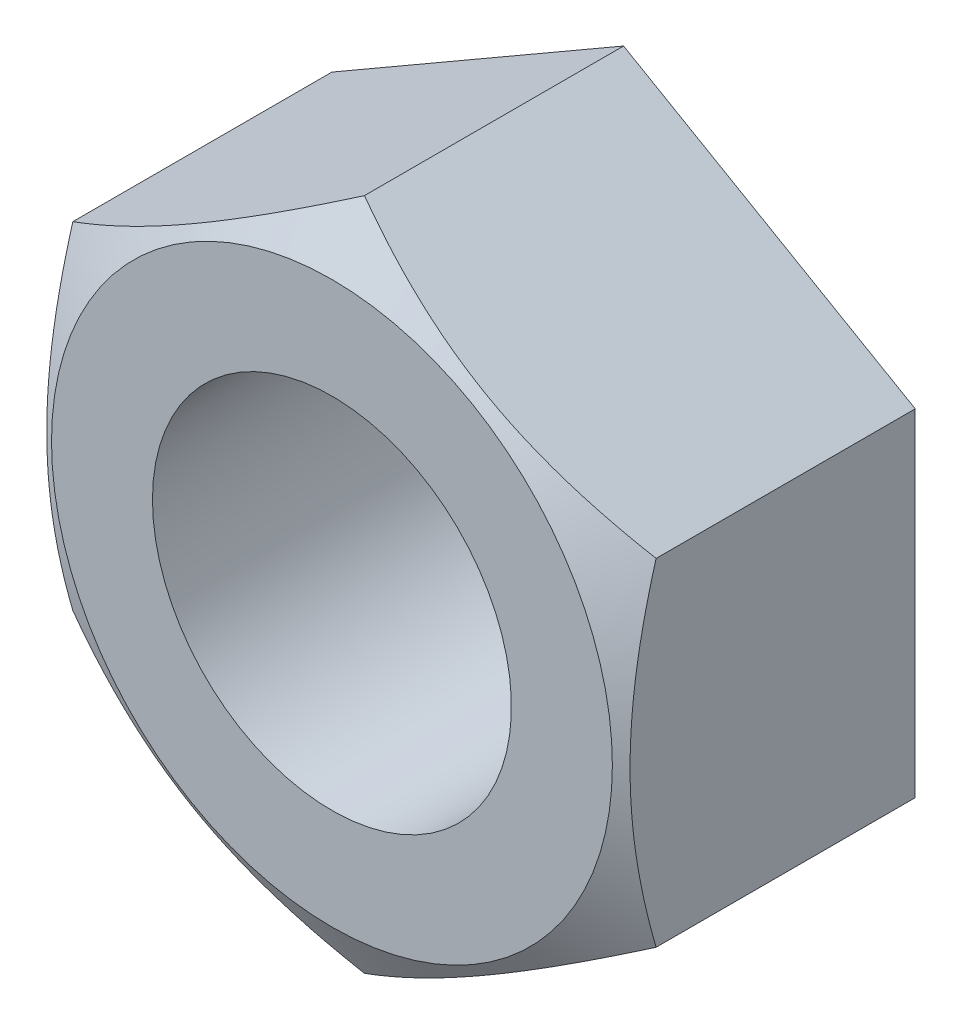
ISO-10303-21;
HEADER;
FILE_DESCRIPTION(('STEP AP214'),'2;1');
FILE_NAME('part.step','',(''),(''),'','','');
FILE_SCHEMA(('AUTOMOTIVE_DESIGN { 1 0 10303 214 1 1 1 1 }'));
ENDSEC;
DATA;
#1=APPLICATION_CONTEXT('core data for automotive mechanical design processes');
#2=APPLICATION_PROTOCOL_DEFINITION('international standard','automotive_design',2000,#1);
#3=PRODUCT_CONTEXT('',#1,'mechanical');
#4=PRODUCT('Part','Part','',(#3));
#5=PRODUCT_RELATED_PRODUCT_CATEGORY('part','',(#4));
#6=PRODUCT_DEFINITION_FORMATION('','',#4);
#7=PRODUCT_DEFINITION_CONTEXT('part definition',#1,'design');
#8=PRODUCT_DEFINITION('design','',#6,#7);
#9=PRODUCT_DEFINITION_SHAPE('','',#8);
#10=(LENGTH_UNIT() NAMED_UNIT(*) SI_UNIT(.MILLI.,.METRE.));
#11=(NAMED_UNIT(*) PLANE_ANGLE_UNIT() SI_UNIT($,.RADIAN.));
#12=(NAMED_UNIT(*) SI_UNIT($,.STERADIAN.) SOLID_ANGLE_UNIT());
#13=UNCERTAINTY_MEASURE_WITH_UNIT(LENGTH_MEASURE(1.E-05),#10,'distance_accuracy_value','');
#14=(GEOMETRIC_REPRESENTATION_CONTEXT(3) GLOBAL_UNCERTAINTY_ASSIGNED_CONTEXT((#13)) GLOBAL_UNIT_ASSIGNED_CONTEXT((#10,
#11,#12)) REPRESENTATION_CONTEXT('',''));
#15=CARTESIAN_POINT('',(0.,0.,0.));
#16=DIRECTION('',(0.,0.,1.));
#17=DIRECTION('',(1.,0.,0.));
#18=AXIS2_PLACEMENT_3D('',#15,#16,#17);
#19=CARTESIAN_POINT('',(-6.5,-3.7527767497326,6.5));
#20=DIRECTION('',(0.5,0.866025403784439,0.));
#21=DIRECTION('',(-0.866025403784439,0.5,0.));
#22=AXIS2_PLACEMENT_3D('',#19,#20,#21);
#23=PLANE('',#22);
#24=DIRECTION('',(0.,0.,-1.));
#25=VECTOR('',#24,1.);
#26=CARTESIAN_POINT('',(0.,-7.5055534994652,6.5));
#27=LINE('',#26,#25);
#28=CARTESIAN_POINT('',(0.,-7.5055534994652,5.77510584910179));
#29=VERTEX_POINT('',#28);
#30=CARTESIAN_POINT('',(0.,-7.5055534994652,0.));
#31=VERTEX_POINT('',#30);
#32=EDGE_CURVE('E9',#29,#31,#27,.T.);
#33=ORIENTED_EDGE('',*,*,#32,.F.);
#34=CARTESIAN_POINT('',(0.000199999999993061,-7.50566896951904,5.77503918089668));
#35=CARTESIAN_POINT('',(-0.142677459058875,-7.42317863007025,5.82265800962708));
#36=CARTESIAN_POINT('',(-0.286087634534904,-7.34038072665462,5.86811573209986));
#37=CARTESIAN_POINT('',(-0.574072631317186,-7.17411251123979,5.95411375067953));
#38=CARTESIAN_POINT('',(-0.718647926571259,-7.09064192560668,5.99465192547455));
#39=CARTESIAN_POINT('',(-1.15468865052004,-6.83889369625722,6.10809143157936));
#40=CARTESIAN_POINT('',(-1.44787528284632,-6.66962231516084,6.17261462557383));
#41=CARTESIAN_POINT('',(-1.88662374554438,-6.41631077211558,6.24827584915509));
#42=CARTESIAN_POINT('',(-2.0308746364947,-6.33302748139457,6.26982957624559));
#43=CARTESIAN_POINT('',(-2.3200282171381,-6.16608458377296,6.30597211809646));
#44=CARTESIAN_POINT('',(-2.4649308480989,-6.08242501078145,6.32056154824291));
#45=CARTESIAN_POINT('',(-2.75498777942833,-5.91496056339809,6.34240368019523));
#46=CARTESIAN_POINT('',(-2.90014160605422,-5.83115596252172,6.34966470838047));
#47=CARTESIAN_POINT('',(-3.19057533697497,-5.66347396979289,6.35670213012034));
#48=CARTESIAN_POINT('',(-3.3358552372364,-5.57959658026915,6.35647875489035));
#49=CARTESIAN_POINT('',(-3.73387594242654,-5.34979921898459,6.34557897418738));
#50=CARTESIAN_POINT('',(-3.9864864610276,-5.2039544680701,6.32728061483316));
#51=CARTESIAN_POINT('',(-4.49002967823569,-4.91323365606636,6.26925609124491));
#52=CARTESIAN_POINT('',(-4.7409606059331,-4.76835861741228,6.22951009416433));
#53=CARTESIAN_POINT('',(-5.24551722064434,-4.47705272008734,6.13015652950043));
#54=CARTESIAN_POINT('',(-5.49907924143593,-4.33065861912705,6.07012800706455));
#55=CARTESIAN_POINT('',(-6.00242193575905,-4.04005357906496,5.93388744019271));
#56=CARTESIAN_POINT('',(-6.25220905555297,-3.89583891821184,5.85770739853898));
#57=CARTESIAN_POINT('',(-6.5002,-3.75266127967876,5.77503918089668));
#58=B_SPLINE_CURVE_WITH_KNOTS('',3,(#34,#35,#36,#37,#38,#39,#40,#41,#42,#43,#44,#45,#46,#47,#48,
#49,#50,#51,#52,#53,#54,#55,#56,#57),.UNSPECIFIED.,.F.,.F.,(4,2,2,2,2,2,2,2,2,2,2,4),(0.,
0.515105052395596,1.03043143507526,2.06322554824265,2.56697389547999,3.07067772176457,
3.57380860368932,4.07692394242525,4.95279354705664,5.8294744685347,6.72559912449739,
7.61996451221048),.UNSPECIFIED.);
#59=CARTESIAN_POINT('',(-6.5,-3.7527767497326,5.77510584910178));
#60=VERTEX_POINT('',#59);
#61=EDGE_CURVE('E67',#29,#60,#58,.T.);
#62=ORIENTED_EDGE('',*,*,#61,.T.);
#63=DIRECTION('',(0.,0.,-1.));
#64=VECTOR('',#63,1.);
#65=CARTESIAN_POINT('',(-6.5,-3.7527767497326,6.5));
#66=LINE('',#65,#64);
#67=CARTESIAN_POINT('',(-6.5,-3.7527767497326,0.));
#68=VERTEX_POINT('',#67);
#69=EDGE_CURVE('E37',#60,#68,#66,.T.);
#70=ORIENTED_EDGE('',*,*,#69,.T.);
#71=DIRECTION('',(0.866025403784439,-0.5,0.));
#72=VECTOR('',#71,1.);
#73=CARTESIAN_POINT('',(-6.5,-3.7527767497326,0.));
#74=LINE('',#73,#72);
#75=EDGE_CURVE('E74',#68,#31,#74,.T.);
#76=ORIENTED_EDGE('',*,*,#75,.T.);
#77=EDGE_LOOP('',(#33,#62,#70,#76));
#78=FACE_BOUND('',#77,.T.);
#79=ADVANCED_FACE('F14',(#78),#23,.F.);
#80=CARTESIAN_POINT('',(0.,-7.5055534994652,6.5));
#81=DIRECTION('',(-0.5,0.866025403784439,0.));
#82=DIRECTION('',(-0.866025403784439,-0.5,0.));
#83=AXIS2_PLACEMENT_3D('',#80,#81,#82);
#84=PLANE('',#83);
#85=DIRECTION('',(0.,0.,-1.));
#86=VECTOR('',#85,1.);
#87=CARTESIAN_POINT('',(6.5,-3.7527767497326,6.5));
#88=LINE('',#87,#86);
#89=CARTESIAN_POINT('',(6.5,-3.7527767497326,5.77510584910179));
#90=VERTEX_POINT('',#89);
#91=CARTESIAN_POINT('',(6.5,-3.7527767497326,0.));
#92=VERTEX_POINT('',#91);
#93=EDGE_CURVE('E22',#90,#92,#88,.T.);
#94=ORIENTED_EDGE('',*,*,#93,.F.);
#95=CARTESIAN_POINT('',(6.5002,-3.75266127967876,5.77503918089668));
#96=CARTESIAN_POINT('',(6.35732254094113,-3.83515161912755,5.82265800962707));
#97=CARTESIAN_POINT('',(6.2139123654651,-3.91794952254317,5.86811573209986));
#98=CARTESIAN_POINT('',(5.92592736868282,-4.084217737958,5.95411375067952));
#99=CARTESIAN_POINT('',(5.78135207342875,-4.16768832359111,5.99465192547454));
#100=CARTESIAN_POINT('',(5.34531134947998,-4.41943655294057,6.10809143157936));
#101=CARTESIAN_POINT('',(5.0521247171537,-4.58870793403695,6.17261462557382));
#102=CARTESIAN_POINT('',(4.61337625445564,-4.8420194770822,6.24827584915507));
#103=CARTESIAN_POINT('',(4.46912536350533,-4.92530276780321,6.26982957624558));
#104=CARTESIAN_POINT('',(4.17997178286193,-5.09224566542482,6.30597211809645));
#105=CARTESIAN_POINT('',(4.03506915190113,-5.17590523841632,6.3205615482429));
#106=CARTESIAN_POINT('',(3.7450122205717,-5.34336968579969,6.34240368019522));
#107=CARTESIAN_POINT('',(3.59985839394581,-5.42717428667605,6.34966470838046));
#108=CARTESIAN_POINT('',(3.30942466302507,-5.59485627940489,6.35670213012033));
#109=CARTESIAN_POINT('',(3.16414476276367,-5.67873366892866,6.35647875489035));
#110=CARTESIAN_POINT('',(2.76612405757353,-5.90853103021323,6.34557897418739));
#111=CARTESIAN_POINT('',(2.51351353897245,-6.05437578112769,6.32728061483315));
#112=CARTESIAN_POINT('',(2.00997032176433,-6.3450965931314,6.26925609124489));
#113=CARTESIAN_POINT('',(1.75903939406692,-6.4899716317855,6.22951009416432));
#114=CARTESIAN_POINT('',(1.25448277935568,-6.78127752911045,6.13015652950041));
#115=CARTESIAN_POINT('',(1.00092075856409,-6.92767163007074,6.07012800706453));
#116=CARTESIAN_POINT('',(0.497578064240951,-7.21827667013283,5.93388744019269));
#117=CARTESIAN_POINT('',(0.24779094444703,-7.36249133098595,5.85770739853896));
#118=CARTESIAN_POINT('',(-0.000200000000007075,-7.50566896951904,5.77503918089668));
#119=B_SPLINE_CURVE_WITH_KNOTS('',3,(#95,#96,#97,#98,#99,#100,#101,#102,#103,#104,#105,#106,
#107,#108,#109,#110,#111,#112,#113,#114,#115,#116,#117,#118),.UNSPECIFIED.,.F.,.F.,(4,2,2,2,2,2,
2,2,2,2,2,4),(0.,0.515105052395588,1.03043143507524,2.06322554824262,2.56697389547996,
3.07067772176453,3.57380860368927,4.07692394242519,4.9527935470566,5.82947446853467,
6.72559912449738,7.61996451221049),.UNSPECIFIED.);
#120=EDGE_CURVE('E75',#90,#29,#119,.T.);
#121=ORIENTED_EDGE('',*,*,#120,.T.);
#122=ORIENTED_EDGE('',*,*,#32,.T.);
#123=DIRECTION('',(0.866025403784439,0.5,0.));
#124=VECTOR('',#123,1.);
#125=CARTESIAN_POINT('',(0.,-7.5055534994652,0.));
#126=LINE('',#125,#124);
#127=EDGE_CURVE('E104',#31,#92,#126,.T.);
#128=ORIENTED_EDGE('',*,*,#127,.T.);
#129=EDGE_LOOP('',(#94,#121,#122,#128));
#130=FACE_BOUND('',#129,.T.);
#131=ADVANCED_FACE('F105',(#130),#84,.F.);
#132=CARTESIAN_POINT('',(6.5,-3.7527767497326,6.5));
#133=DIRECTION('',(-1.,0.,0.));
#134=DIRECTION('',(0.,0.,1.));
#135=AXIS2_PLACEMENT_3D('',#132,#133,#134);
#136=PLANE('',#135);
#137=DIRECTION('',(0.,0.,-1.));
#138=VECTOR('',#137,1.);
#139=CARTESIAN_POINT('',(6.5,3.75277674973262,6.5));
#140=LINE('',#139,#138);
#141=CARTESIAN_POINT('',(6.5,3.75277674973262,5.77510584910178));
#142=VERTEX_POINT('',#141);
#143=CARTESIAN_POINT('',(6.5,3.75277674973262,0.));
#144=VERTEX_POINT('',#143);
#145=EDGE_CURVE('E90',#142,#144,#140,.T.);
#146=ORIENTED_EDGE('',*,*,#145,.F.);
#147=CARTESIAN_POINT('',(6.5,-10.0608689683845,3.19297138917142));
#148=CARTESIAN_POINT('',(6.5,-9.77713326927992,3.33052992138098));
#149=CARTESIAN_POINT('',(6.5,-9.49274412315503,3.46676381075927));
#150=CARTESIAN_POINT('',(6.5,-8.92231136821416,3.73583689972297));
#151=CARTESIAN_POINT('',(6.5,-8.63626750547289,3.86867556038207));
#152=CARTESIAN_POINT('',(6.5,-8.06069458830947,4.13088527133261));
#153=CARTESIAN_POINT('',(6.5,-7.7711550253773,4.26023333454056));
#154=CARTESIAN_POINT('',(6.5,-7.18976610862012,4.51360986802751));
#155=CARTESIAN_POINT('',(6.5,-6.89791686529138,4.63763859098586));
#156=CARTESIAN_POINT('',(6.5,-6.30210253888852,4.88281564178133));
#157=CARTESIAN_POINT('',(6.5,-5.99804751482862,5.0037465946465));
#158=CARTESIAN_POINT('',(6.5,-5.38637271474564,5.23640846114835));
#159=CARTESIAN_POINT('',(6.5,-5.07875254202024,5.3481383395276));
#160=CARTESIAN_POINT('',(6.5,-4.46004135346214,5.55945095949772));
#161=CARTESIAN_POINT('',(6.5,-4.14895887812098,5.65905845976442));
#162=CARTESIAN_POINT('',(6.5,-3.52232845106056,5.84291601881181));
#163=CARTESIAN_POINT('',(6.5,-3.20678194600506,5.92717093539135));
#164=CARTESIAN_POINT('',(6.5,-2.57280630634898,6.07582411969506));
#165=CARTESIAN_POINT('',(6.5,-2.25440263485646,6.14032923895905));
#166=CARTESIAN_POINT('',(6.5,-1.61361130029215,6.24580774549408));
#167=CARTESIAN_POINT('',(6.5,-1.29122401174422,6.28678332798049));
#168=CARTESIAN_POINT('',(6.5,-0.808080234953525,6.32787830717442));
#169=CARTESIAN_POINT('',(6.5,-0.648149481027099,6.33817944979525));
#170=CARTESIAN_POINT('',(6.5,-0.327988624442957,6.35201647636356));
#171=CARTESIAN_POINT('',(6.5,-0.167758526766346,6.35555247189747));
#172=CARTESIAN_POINT('',(6.5,0.152706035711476,6.35576736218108));
#173=CARTESIAN_POINT('',(6.5,0.312940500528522,6.3524462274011));
#174=CARTESIAN_POINT('',(6.5,0.633128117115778,6.33902969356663));
#175=CARTESIAN_POINT('',(6.5,0.793081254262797,6.32893395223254));
#176=CARTESIAN_POINT('',(6.5,1.17808919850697,6.29669232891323));
#177=CARTESIAN_POINT('',(6.5,1.40287767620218,6.27129901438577));
#178=CARTESIAN_POINT('',(6.5,1.85076289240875,6.20852183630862));
#179=CARTESIAN_POINT('',(6.5,2.07385939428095,6.17113632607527));
#180=CARTESIAN_POINT('',(6.5,2.74036877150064,6.04297579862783));
#181=CARTESIAN_POINT('',(6.5,3.180748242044,5.93622078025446));
#182=CARTESIAN_POINT('',(6.5,3.83921118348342,5.75138979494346));
#183=CARTESIAN_POINT('',(6.5,4.060717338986,5.68480844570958));
#184=CARTESIAN_POINT('',(6.5,4.50157768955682,5.54480307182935));
#185=CARTESIAN_POINT('',(6.5,4.72093187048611,5.47137900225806));
#186=CARTESIAN_POINT('',(6.5,5.15755871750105,5.31886022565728));
#187=CARTESIAN_POINT('',(6.5,5.37483205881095,5.23976743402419));
#188=CARTESIAN_POINT('',(6.5,5.8075834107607,5.07683457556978));
#189=CARTESIAN_POINT('',(6.5,6.02306144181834,4.99299456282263));
#190=CARTESIAN_POINT('',(6.5,6.52913687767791,4.7906901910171));
#191=CARTESIAN_POINT('',(6.5,6.81906619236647,4.67055771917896));
#192=CARTESIAN_POINT('',(6.5,7.39648228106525,4.42454293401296));
#193=CARTESIAN_POINT('',(6.5,7.68396890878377,4.29866027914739));
#194=CARTESIAN_POINT('',(6.5,8.2569458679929,4.04229336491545));
#195=CARTESIAN_POINT('',(6.5,8.54243579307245,3.91180819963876));
#196=CARTESIAN_POINT('',(6.5,9.11170506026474,3.64715183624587));
#197=CARTESIAN_POINT('',(6.5,9.39548436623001,3.5129805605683));
#198=CARTESIAN_POINT('',(6.5,9.96190304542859,3.24150020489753));
#199=CARTESIAN_POINT('',(6.5,10.2445409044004,3.10418797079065));
#200=CARTESIAN_POINT('',(6.5,10.8086039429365,2.82709265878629));
#201=CARTESIAN_POINT('',(6.5,11.0900291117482,2.68730955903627));
#202=CARTESIAN_POINT('',(6.5,11.9327004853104,2.26494440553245));
#203=CARTESIAN_POINT('',(6.5,12.4924169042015,1.97931057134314));
#204=CARTESIAN_POINT('',(6.5,13.5624406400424,1.42631051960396));
#205=CARTESIAN_POINT('',(6.5,14.0729851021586,1.15940112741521));
#206=CARTESIAN_POINT('',(6.5,15.0921765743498,0.621944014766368));
#207=CARTESIAN_POINT('',(6.5,15.6008235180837,0.35139616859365));
#208=CARTESIAN_POINT('',(6.5,16.6153877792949,-0.191804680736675));
#209=CARTESIAN_POINT('',(6.5,17.1213087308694,-0.464450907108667));
#210=CARTESIAN_POINT('',(6.5,18.1319361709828,-1.0119206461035));
#211=CARTESIAN_POINT('',(6.5,18.6366427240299,-1.28674403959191));
#212=CARTESIAN_POINT('',(6.5,19.14090167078,-1.56238079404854));
#213=B_SPLINE_CURVE_WITH_KNOTS('',3,(#147,#148,#149,#150,#151,#152,#153,#154,#155,#156,#157,
#158,#159,#160,#161,#162,#163,#164,#165,#166,#167,#168,#169,#170,#171,#172,#173,#174,#175,#176,
#177,#178,#179,#180,#181,#182,#183,#184,#185,#186,#187,#188,#189,#190,#191,#192,#193,#194,#195,
#196,#197,#198,#199,#200,#201,#202,#203,#204,#205,#206,#207,#208,#209,#210,#211,#212),
.UNSPECIFIED.,.F.,.F.,(4,2,2,2,2,2,2,2,2,2,2,2,2,2,2,2,2,2,2,2,2,2,2,2,2,2,2,2,2,2,2,2,4),(0.,
0.945979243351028,1.89210772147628,2.84342009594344,3.79468723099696,4.77623606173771,
5.7578951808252,6.73751446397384,7.71682323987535,8.69073605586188,9.66455799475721,
10.1452231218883,10.6258803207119,11.1065395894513,11.5872231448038,12.2654942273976,
12.9438584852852,14.3013468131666,14.9951792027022,15.6890161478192,16.3826197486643,
17.0762154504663,18.0176294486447,18.9590994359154,19.9007557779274,20.8424319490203,
21.7850993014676,22.7277749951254,24.6128786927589,26.3411762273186,28.0695336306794,
29.7936589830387,31.5176906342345),.UNSPECIFIED.);
#214=EDGE_CURVE('E101',#142,#90,#213,.F.);
#215=ORIENTED_EDGE('',*,*,#214,.T.);
#216=ORIENTED_EDGE('',*,*,#93,.T.);
#217=DIRECTION('',(0.,1.,0.));
#218=VECTOR('',#217,1.);
#219=CARTESIAN_POINT('',(6.5,-3.7527767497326,0.));
#220=LINE('',#219,#218);
#221=EDGE_CURVE('E99',#92,#144,#220,.T.);
#222=ORIENTED_EDGE('',*,*,#221,.T.);
#223=EDGE_LOOP('',(#146,#215,#216,#222));
#224=FACE_BOUND('',#223,.T.);
#225=ADVANCED_FACE('F97',(#224),#136,.F.);
#226=CARTESIAN_POINT('',(6.5,3.75277674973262,6.5));
#227=DIRECTION('',(-0.5,-0.866025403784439,0.));
#228=DIRECTION('',(0.866025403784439,-0.5,0.));
#229=AXIS2_PLACEMENT_3D('',#226,#227,#228);
#230=PLANE('',#229);
#231=DIRECTION('',(0.,0.,-1.));
#232=VECTOR('',#231,1.);
#233=CARTESIAN_POINT('',(0.,7.50555349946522,6.5));
#234=LINE('',#233,#232);
#235=CARTESIAN_POINT('',(0.,7.50555349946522,5.77510584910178));
#236=VERTEX_POINT('',#235);
#237=CARTESIAN_POINT('',(0.,7.50555349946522,0.));
#238=VERTEX_POINT('',#237);
#239=EDGE_CURVE('E83',#236,#238,#234,.T.);
#240=ORIENTED_EDGE('',*,*,#239,.F.);
#241=CARTESIAN_POINT('',(-0.000199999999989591,7.50566896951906,5.77503918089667));
#242=CARTESIAN_POINT('',(0.14267745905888,7.42317863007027,5.82265800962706));
#243=CARTESIAN_POINT('',(0.28608763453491,7.34038072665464,5.86811573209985));
#244=CARTESIAN_POINT('',(0.574072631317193,7.17411251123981,5.95411375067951));
#245=CARTESIAN_POINT('',(0.718647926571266,7.0906419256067,5.99465192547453));
#246=CARTESIAN_POINT('',(1.15468865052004,6.83889369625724,6.10809143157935));
#247=CARTESIAN_POINT('',(1.44787528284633,6.66962231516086,6.17261462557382));
#248=CARTESIAN_POINT('',(1.88662374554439,6.4163107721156,6.24827584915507));
#249=CARTESIAN_POINT('',(2.03087463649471,6.33302748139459,6.26982957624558));
#250=CARTESIAN_POINT('',(2.32002821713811,6.16608458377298,6.30597211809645));
#251=CARTESIAN_POINT('',(2.46493084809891,6.08242501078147,6.3205615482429));
#252=CARTESIAN_POINT('',(2.75498777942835,5.9149605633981,6.34240368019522));
#253=CARTESIAN_POINT('',(2.90014160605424,5.83115596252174,6.34966470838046));
#254=CARTESIAN_POINT('',(3.19057533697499,5.66347396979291,6.35670213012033));
#255=CARTESIAN_POINT('',(3.33585523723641,5.57959658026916,6.35647875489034));
#256=CARTESIAN_POINT('',(3.73387594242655,5.3497992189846,6.34557897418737));
#257=CARTESIAN_POINT('',(3.98648646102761,5.20395446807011,6.32728061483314));
#258=CARTESIAN_POINT('',(4.49002967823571,4.91323365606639,6.2692560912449));
#259=CARTESIAN_POINT('',(4.74096060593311,4.7683586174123,6.22951009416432));
#260=CARTESIAN_POINT('',(5.24551722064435,4.47705272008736,6.13015652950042));
#261=CARTESIAN_POINT('',(5.49907924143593,4.33065861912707,6.07012800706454));
#262=CARTESIAN_POINT('',(6.00242193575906,4.04005357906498,5.9338874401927));
#263=CARTESIAN_POINT('',(6.25220905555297,3.89583891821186,5.85770739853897));
#264=CARTESIAN_POINT('',(6.5002,3.75266127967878,5.77503918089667));
#265=B_SPLINE_CURVE_WITH_KNOTS('',3,(#241,#242,#243,#244,#245,#246,#247,#248,#249,#250,#251,
#252,#253,#254,#255,#256,#257,#258,#259,#260,#261,#262,#263,#264),.UNSPECIFIED.,.F.,.F.,(4,2,2,
2,2,2,2,2,2,2,2,4),(0.,0.515105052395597,1.03043143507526,2.06322554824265,2.56697389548,
3.07067772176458,3.57380860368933,4.07692394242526,4.95279354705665,5.8294744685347,
6.72559912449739,7.61996451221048),.UNSPECIFIED.);
#266=EDGE_CURVE('E156',#236,#142,#265,.T.);
#267=ORIENTED_EDGE('',*,*,#266,.T.);
#268=ORIENTED_EDGE('',*,*,#145,.T.);
#269=DIRECTION('',(-0.866025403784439,0.5,0.));
#270=VECTOR('',#269,1.);
#271=CARTESIAN_POINT('',(6.5,3.75277674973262,0.));
#272=LINE('',#271,#270);
#273=EDGE_CURVE('E111',#144,#238,#272,.T.);
#274=ORIENTED_EDGE('',*,*,#273,.T.);
#275=EDGE_LOOP('',(#240,#267,#268,#274));
#276=FACE_BOUND('',#275,.T.);
#277=ADVANCED_FACE('F169',(#276),#230,.F.);
#278=CARTESIAN_POINT('',(0.,7.50555349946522,6.5));
#279=DIRECTION('',(0.5,-0.866025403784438,0.));
#280=DIRECTION('',(0.866025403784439,0.5,0.));
#281=AXIS2_PLACEMENT_3D('',#278,#279,#280);
#282=PLANE('',#281);
#283=DIRECTION('',(0.,0.,-1.));
#284=VECTOR('',#283,1.);
#285=CARTESIAN_POINT('',(-6.5,3.75277674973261,6.5));
#286=LINE('',#285,#284);
#287=CARTESIAN_POINT('',(-6.5,3.75277674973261,5.77510584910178));
#288=VERTEX_POINT('',#287);
#289=CARTESIAN_POINT('',(-6.5,3.75277674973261,0.));
#290=VERTEX_POINT('',#289);
#291=EDGE_CURVE('E81',#288,#290,#286,.T.);
#292=ORIENTED_EDGE('',*,*,#291,.F.);
#293=CARTESIAN_POINT('',(-6.5002,3.75266127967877,5.77503918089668));
#294=CARTESIAN_POINT('',(-6.35732254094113,3.83515161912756,5.82265800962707));
#295=CARTESIAN_POINT('',(-6.2139123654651,3.91794952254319,5.86811573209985));
#296=CARTESIAN_POINT('',(-5.92592736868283,4.08421773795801,5.95411375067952));
#297=CARTESIAN_POINT('',(-5.78135207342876,4.16768832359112,5.99465192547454));
#298=CARTESIAN_POINT('',(-5.34531134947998,4.41943655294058,6.10809143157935));
#299=CARTESIAN_POINT('',(-5.0521247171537,4.58870793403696,6.17261462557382));
#300=CARTESIAN_POINT('',(-4.61337625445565,4.84201947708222,6.24827584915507));
#301=CARTESIAN_POINT('',(-4.46912536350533,4.92530276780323,6.26982957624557));
#302=CARTESIAN_POINT('',(-4.17997178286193,5.09224566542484,6.30597211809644));
#303=CARTESIAN_POINT('',(-4.03506915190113,5.17590523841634,6.32056154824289));
#304=CARTESIAN_POINT('',(-3.7450122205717,5.3433696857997,6.34240368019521));
#305=CARTESIAN_POINT('',(-3.59985839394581,5.42717428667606,6.34966470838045));
#306=CARTESIAN_POINT('',(-3.30942466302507,5.5948562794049,6.35670213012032));
#307=CARTESIAN_POINT('',(-3.16414476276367,5.67873366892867,6.35647875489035));
#308=CARTESIAN_POINT('',(-2.76612405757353,5.90853103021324,6.34557897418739));
#309=CARTESIAN_POINT('',(-2.51351353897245,6.0543757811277,6.32728061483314));
#310=CARTESIAN_POINT('',(-2.00997032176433,6.34509659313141,6.26925609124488));
#311=CARTESIAN_POINT('',(-1.75903939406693,6.48997163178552,6.22951009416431));
#312=CARTESIAN_POINT('',(-1.25448277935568,6.78127752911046,6.1301565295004));
#313=CARTESIAN_POINT('',(-1.00092075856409,6.92767163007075,6.07012800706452));
#314=CARTESIAN_POINT('',(-0.497578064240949,7.21827667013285,5.93388744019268));
#315=CARTESIAN_POINT('',(-0.247790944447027,7.36249133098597,5.85770739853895));
#316=CARTESIAN_POINT('',(0.000200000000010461,7.50566896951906,5.77503918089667));
#317=B_SPLINE_CURVE_WITH_KNOTS('',3,(#293,#294,#295,#296,#297,#298,#299,#300,#301,#302,#303,
#304,#305,#306,#307,#308,#309,#310,#311,#312,#313,#314,#315,#316),.UNSPECIFIED.,.F.,.F.,(4,2,2,
2,2,2,2,2,2,2,2,4),(0.,0.515105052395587,1.03043143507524,2.06322554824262,2.56697389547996,
3.07067772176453,3.57380860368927,4.07692394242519,4.95279354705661,5.82947446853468,
6.72559912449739,7.61996451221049),.UNSPECIFIED.);
#318=EDGE_CURVE('E29',#288,#236,#317,.T.);
#319=ORIENTED_EDGE('',*,*,#318,.T.);
#320=ORIENTED_EDGE('',*,*,#239,.T.);
#321=DIRECTION('',(-0.866025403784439,-0.5,0.));
#322=VECTOR('',#321,1.);
#323=CARTESIAN_POINT('',(0.,7.50555349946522,0.));
#324=LINE('',#323,#322);
#325=EDGE_CURVE('E85',#238,#290,#324,.T.);
#326=ORIENTED_EDGE('',*,*,#325,.T.);
#327=EDGE_LOOP('',(#292,#319,#320,#326));
#328=FACE_BOUND('',#327,.T.);
#329=ADVANCED_FACE('F117',(#328),#282,.F.);
#330=CARTESIAN_POINT('',(-6.5,3.75277674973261,6.5));
#331=DIRECTION('',(1.,0.,0.));
#332=DIRECTION('',(0.,1.,0.));
#333=AXIS2_PLACEMENT_3D('',#330,#331,#332);
#334=PLANE('',#333);
#335=ORIENTED_EDGE('',*,*,#69,.F.);
#336=CARTESIAN_POINT('',(-6.5,-10.0608689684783,3.19297138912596));
#337=CARTESIAN_POINT('',(-6.5,-9.77713326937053,3.33052992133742));
#338=CARTESIAN_POINT('',(-6.50000000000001,-9.49274412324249,3.46676381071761));
#339=CARTESIAN_POINT('',(-6.50000000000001,-8.9223113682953,3.7358368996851));
#340=CARTESIAN_POINT('',(-6.50000000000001,-8.63626750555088,3.8686755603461));
#341=CARTESIAN_POINT('',(-6.50000000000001,-8.06069458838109,4.13088527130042));
#342=CARTESIAN_POINT('',(-6.50000000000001,-7.77115502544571,4.26023333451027));
#343=CARTESIAN_POINT('',(-6.50000000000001,-7.18976610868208,4.51360986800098));
#344=CARTESIAN_POINT('',(-6.50000000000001,-6.89791686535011,4.63763859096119));
#345=CARTESIAN_POINT('',(-6.50000000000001,-6.30210253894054,4.88281564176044));
#346=CARTESIAN_POINT('',(-6.5,-5.99804751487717,5.00374659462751));
#347=CARTESIAN_POINT('',(-6.5,-5.38637271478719,5.23640846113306));
#348=CARTESIAN_POINT('',(-6.5,-5.07875254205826,5.34813833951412));
#349=CARTESIAN_POINT('',(-6.5,-4.46004135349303,5.55945095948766));
#350=CARTESIAN_POINT('',(-6.5,-4.14895887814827,5.65905845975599));
#351=CARTESIAN_POINT('',(-6.5,-3.52232845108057,5.84291601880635));
#352=CARTESIAN_POINT('',(-6.5,-3.20678194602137,5.92717093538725));
#353=CARTESIAN_POINT('',(-6.5,-2.57280630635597,6.07582411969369));
#354=CARTESIAN_POINT('',(-6.5,-2.2544026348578,6.14032923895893));
#355=CARTESIAN_POINT('',(-6.5,-1.61361130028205,6.24580774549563));
#356=CARTESIAN_POINT('',(-6.5,-1.29122401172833,6.28678332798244));
#357=CARTESIAN_POINT('',(-6.5,-0.808080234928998,6.32787830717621));
#358=CARTESIAN_POINT('',(-6.5,-0.648149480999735,6.33817944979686));
#359=CARTESIAN_POINT('',(-6.5,-0.327988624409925,6.35201647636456));
#360=CARTESIAN_POINT('',(-6.5,-0.167758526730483,6.35555247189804));
#361=CARTESIAN_POINT('',(-6.5,0.152706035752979,6.35576736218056));
#362=CARTESIAN_POINT('',(-6.5,0.312940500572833,6.35244622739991));
#363=CARTESIAN_POINT('',(-6.5,0.633128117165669,6.33902969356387));
#364=CARTESIAN_POINT('',(-6.5,0.793081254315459,6.32893395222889));
#365=CARTESIAN_POINT('',(-6.5,1.17808919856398,6.29669232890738));
#366=CARTESIAN_POINT('',(-6.5,1.40287767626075,6.27129901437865));
#367=CARTESIAN_POINT('',(-6.5,1.85076289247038,6.20852183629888));
#368=CARTESIAN_POINT('',(-6.5,2.07385939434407,6.1711363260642));
#369=CARTESIAN_POINT('',(-6.5,2.74036877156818,6.04297579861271));
#370=CARTESIAN_POINT('',(-6.5,3.18074824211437,5.9362207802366));
#371=CARTESIAN_POINT('',(-6.5,3.83921118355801,5.75138979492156));
#372=CARTESIAN_POINT('',(-6.5,4.06071733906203,5.68480844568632));
#373=CARTESIAN_POINT('',(-6.5,4.50157768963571,5.54480307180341));
#374=CARTESIAN_POINT('',(-6.5,4.72093187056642,5.4713790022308));
#375=CARTESIAN_POINT('',(-6.5,5.1575587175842,5.31886022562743));
#376=CARTESIAN_POINT('',(-6.5,5.37483205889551,5.23976743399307));
#377=CARTESIAN_POINT('',(-6.5,5.80758341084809,5.07683457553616));
#378=CARTESIAN_POINT('',(-6.5,6.02306144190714,4.99299456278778));
#379=CARTESIAN_POINT('',(-6.5,6.52913687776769,4.79069019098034));
#380=CARTESIAN_POINT('',(-6.5,6.81906619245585,4.67055771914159));
#381=CARTESIAN_POINT('',(-6.5,7.39648228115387,4.42454293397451));
#382=CARTESIAN_POINT('',(-6.5,7.68396890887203,4.29866027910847));
#383=CARTESIAN_POINT('',(-6.5,8.25694586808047,4.0422933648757));
#384=CARTESIAN_POINT('',(-6.5,8.5424357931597,3.91180819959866));
#385=CARTESIAN_POINT('',(-6.5,9.11170506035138,3.64715183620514));
#386=CARTESIAN_POINT('',(-6.5,9.39548436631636,3.51298056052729));
#387=CARTESIAN_POINT('',(-6.5,9.96190304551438,3.24150020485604));
#388=CARTESIAN_POINT('',(-6.5,10.244540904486,3.10418797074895));
#389=CARTESIAN_POINT('',(-6.5,10.8086039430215,2.82709265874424));
#390=CARTESIAN_POINT('',(-6.5,11.0900291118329,2.68730955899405));
#391=CARTESIAN_POINT('',(-6.5,11.9327004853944,2.26494440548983));
#392=CARTESIAN_POINT('',(-6.5,12.4924169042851,1.97931057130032));
#393=CARTESIAN_POINT('',(-6.5,13.5624406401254,1.42631051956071));
#394=CARTESIAN_POINT('',(-6.49999999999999,14.0729851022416,1.15940112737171));
#395=CARTESIAN_POINT('',(-6.49999999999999,15.0921765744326,0.621944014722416));
#396=CARTESIAN_POINT('',(-6.49999999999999,15.6008235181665,0.351396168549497));
#397=CARTESIAN_POINT('',(-6.49999999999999,16.6153877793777,-0.191804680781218));
#398=CARTESIAN_POINT('',(-6.49999999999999,17.1213087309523,-0.464450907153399));
#399=CARTESIAN_POINT('',(-6.49999999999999,18.1319361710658,-1.01192064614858));
#400=CARTESIAN_POINT('',(-6.5,18.6366427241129,-1.28674403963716));
#401=CARTESIAN_POINT('',(-6.5,19.1409016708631,-1.56238079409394));
#402=B_SPLINE_CURVE_WITH_KNOTS('',3,(#336,#337,#338,#339,#340,#341,#342,#343,#344,#345,#346,
#347,#348,#349,#350,#351,#352,#353,#354,#355,#356,#357,#358,#359,#360,#361,#362,#363,#364,#365,
#366,#367,#368,#369,#370,#371,#372,#373,#374,#375,#376,#377,#378,#379,#380,#381,#382,#383,#384,
#385,#386,#387,#388,#389,#390,#391,#392,#393,#394,#395,#396,#397,#398,#399,#400,#401),
.UNSPECIFIED.,.F.,.F.,(4,2,2,2,2,2,2,2,2,2,2,2,2,2,2,2,2,2,2,2,2,2,2,2,2,2,2,2,2,2,2,2,4),(0.,
0.945979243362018,1.89210772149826,2.84342009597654,3.79468723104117,4.77623606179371,
5.75789518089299,6.73751446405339,7.71682323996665,8.69073605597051,9.66455799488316,
10.1452231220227,10.6258803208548,11.1065395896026,11.5872231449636,12.2654942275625,
12.9438584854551,14.3013468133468,14.9951792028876,15.68901614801,16.3826197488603,
17.0762154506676,18.0176294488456,18.9590994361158,19.9007557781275,20.84243194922,
21.7850993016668,22.7277749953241,24.6128786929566,26.3411762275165,28.0695336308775,
29.7936589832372,31.5176906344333),.UNSPECIFIED.);
#403=EDGE_CURVE('E65',#60,#288,#402,.T.);
#404=ORIENTED_EDGE('',*,*,#403,.T.);
#405=ORIENTED_EDGE('',*,*,#291,.T.);
#406=DIRECTION('',(0.,-1.,0.));
#407=VECTOR('',#406,1.);
#408=CARTESIAN_POINT('',(-6.5,3.75277674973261,0.));
#409=LINE('',#408,#407);
#410=EDGE_CURVE('E79',#290,#68,#409,.T.);
#411=ORIENTED_EDGE('',*,*,#410,.T.);
#412=EDGE_LOOP('',(#335,#404,#405,#411));
#413=FACE_BOUND('',#412,.T.);
#414=ADVANCED_FACE('F77',(#413),#334,.F.);
#415=CARTESIAN_POINT('',(-6.5,-3.7527767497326,0.));
#416=DIRECTION('',(0.,0.,-1.));
#417=DIRECTION('',(-1.,0.,0.));
#418=AXIS2_PLACEMENT_3D('',#415,#416,#417);
#419=PLANE('',#418);
#420=CARTESIAN_POINT('',(0.,0.,0.));
#421=DIRECTION('',(0.,0.,-1.));
#422=DIRECTION('',(-1.,0.,0.));
#423=AXIS2_PLACEMENT_3D('',#420,#421,#422);
#424=CIRCLE('',#423,4.);
#425=CARTESIAN_POINT('',(-4.,0.,0.));
#426=VERTEX_POINT('',#425);
#427=EDGE_CURVE('E248',#426,#426,#424,.T.);
#428=ORIENTED_EDGE('',*,*,#427,.F.);
#429=EDGE_LOOP('',(#428));
#430=FACE_BOUND('',#429,.T.);
#431=ORIENTED_EDGE('',*,*,#75,.F.);
#432=ORIENTED_EDGE('',*,*,#410,.F.);
#433=ORIENTED_EDGE('',*,*,#325,.F.);
#434=ORIENTED_EDGE('',*,*,#273,.F.);
#435=ORIENTED_EDGE('',*,*,#221,.F.);
#436=ORIENTED_EDGE('',*,*,#127,.F.);
#437=EDGE_LOOP('',(#431,#432,#433,#434,#435,#436));
#438=FACE_BOUND('',#437,.T.);
#439=ADVANCED_FACE('F108',(#430,#438),#419,.T.);
#440=CARTESIAN_POINT('',(0.,0.,6.5));
#441=DIRECTION('',(0.,0.,-1.));
#442=DIRECTION('',(-1.,0.,0.));
#443=AXIS2_PLACEMENT_3D('',#440,#441,#442);
#444=CONICAL_SURFACE('',#443,6.25,1.0471975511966);
#445=CARTESIAN_POINT('',(0.,0.,6.5));
#446=DIRECTION('',(0.,0.,-1.));
#447=DIRECTION('',(-1.,0.,0.));
#448=AXIS2_PLACEMENT_3D('',#445,#446,#447);
#449=CIRCLE('',#448,6.25);
#450=CARTESIAN_POINT('',(-6.25,0.,6.5));
#451=VERTEX_POINT('',#450);
#452=EDGE_CURVE('E71',#451,#451,#449,.T.);
#453=ORIENTED_EDGE('',*,*,#452,.T.);
#454=EDGE_LOOP('',(#453));
#455=FACE_BOUND('',#454,.T.);
#456=ORIENTED_EDGE('',*,*,#120,.F.);
#457=ORIENTED_EDGE('',*,*,#214,.F.);
#458=ORIENTED_EDGE('',*,*,#266,.F.);
#459=ORIENTED_EDGE('',*,*,#318,.F.);
#460=ORIENTED_EDGE('',*,*,#403,.F.);
#461=ORIENTED_EDGE('',*,*,#61,.F.);
#462=EDGE_LOOP('',(#456,#457,#458,#459,#460,#461));
#463=FACE_BOUND('',#462,.T.);
#464=ADVANCED_FACE('F66',(#455,#463),#444,.T.);
#465=CARTESIAN_POINT('',(-6.5,-3.7527767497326,6.5));
#466=DIRECTION('',(0.,0.,-1.));
#467=DIRECTION('',(-1.,0.,0.));
#468=AXIS2_PLACEMENT_3D('',#465,#466,#467);
#469=PLANE('',#468);
#470=CARTESIAN_POINT('',(0.,0.,6.5));
#471=DIRECTION('',(0.,0.,-1.));
#472=DIRECTION('',(-1.,0.,0.));
#473=AXIS2_PLACEMENT_3D('',#470,#471,#472);
#474=CIRCLE('',#473,4.);
#475=CARTESIAN_POINT('',(-4.,0.,6.5));
#476=VERTEX_POINT('',#475);
#477=EDGE_CURVE('E245',#476,#476,#474,.T.);
#478=ORIENTED_EDGE('',*,*,#477,.T.);
#479=EDGE_LOOP('',(#478));
#480=FACE_BOUND('',#479,.T.);
#481=ORIENTED_EDGE('',*,*,#452,.F.);
#482=EDGE_LOOP('',(#481));
#483=FACE_BOUND('',#482,.T.);
#484=ADVANCED_FACE('F134',(#480,#483),#469,.F.);
#485=CARTESIAN_POINT('',(0.,0.,6.5));
#486=DIRECTION('',(0.,0.,-1.));
#487=DIRECTION('',(-1.,0.,0.));
#488=AXIS2_PLACEMENT_3D('',#485,#486,#487);
#489=CYLINDRICAL_SURFACE('',#488,4.);
#490=ORIENTED_EDGE('',*,*,#477,.F.);
#491=EDGE_LOOP('',(#490));
#492=FACE_BOUND('',#491,.T.);
#493=ORIENTED_EDGE('',*,*,#427,.T.);
#494=EDGE_LOOP('',(#493));
#495=FACE_BOUND('',#494,.T.);
#496=ADVANCED_FACE('F136',(#492,#495),#489,.F.);
#497=CLOSED_SHELL('',(#79,#131,#225,#277,#329,#414,#439,#464,#484,#496));
#498=MANIFOLD_SOLID_BREP('B1',#497);
#499=ADVANCED_BREP_SHAPE_REPRESENTATION('',(#18,#498),#14);
#500=SHAPE_DEFINITION_REPRESENTATION(#9,#499);
ENDSEC;
END-ISO-10303-21;
